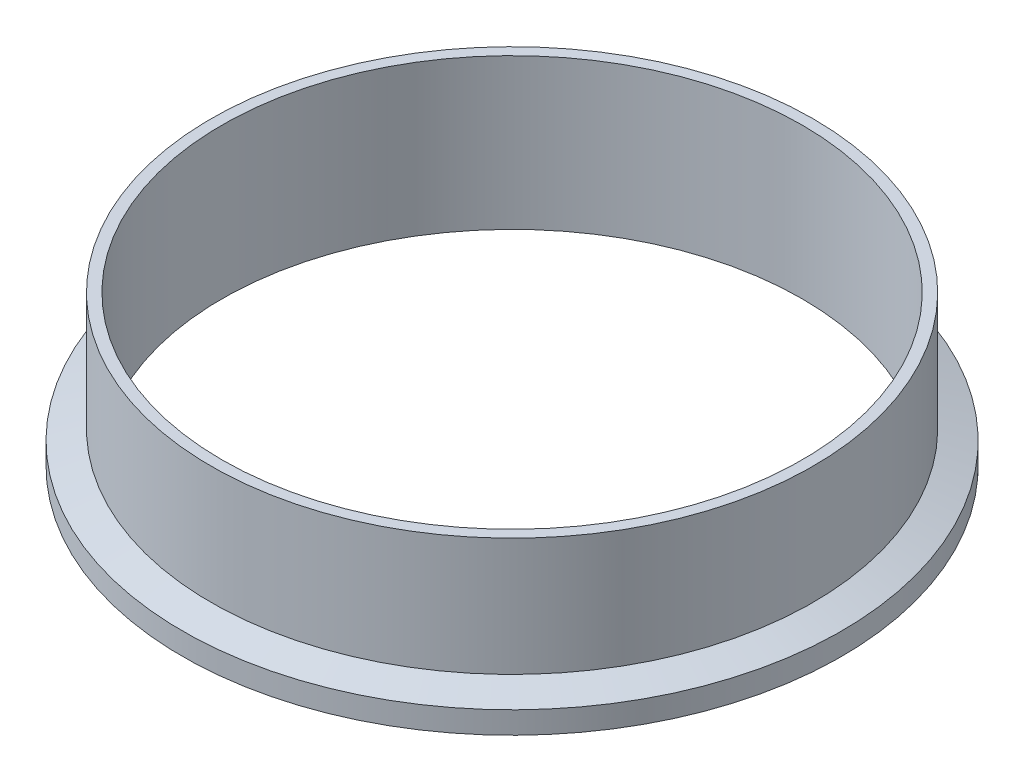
from build123d import *


with BuildPart() as part:
    # Sketch1 → Revolve2 (revolve)
    with BuildSketch(Plane.XY, mode=Mode.PRIVATE) as revolve2_sk:
        with BuildLine():
            Line((-73.4314, 0), (-73.4314, 38.1))
            Line((-73.4314, 38.1), (-76.2, 38.1))
            Line((-76.2, 38.1), (-76.2, 8.222780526))
            Line((-76.2, 8.222780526), (-83.439, 5.588))
            Line((-83.439, 5.588), (-83.439, 0))
            Line((-83.439, 0), (-79.999208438, 0))
            ThreePointArc((-79.999208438, 0), (-79.567011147, 0.129217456), (-79.276666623, 0.474458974))
            ThreePointArc((-79.276666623, 0.474458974), (-78.1812, 1.1938), (-77.085733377, 0.474458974))
            ThreePointArc((-77.085733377, 0.474458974), (-76.795388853, 0.129217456), (-76.363191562, 0))
            Line((-76.363191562, 0), (-73.4314, 0))
        make_face()
    revolve(revolve2_sk.sketch.rotate(Axis((0, 0, 0), (0, 1, 0)), 270), axis=Axis((0, 0, 0), (0, 1, 0)))


solid = part.part
